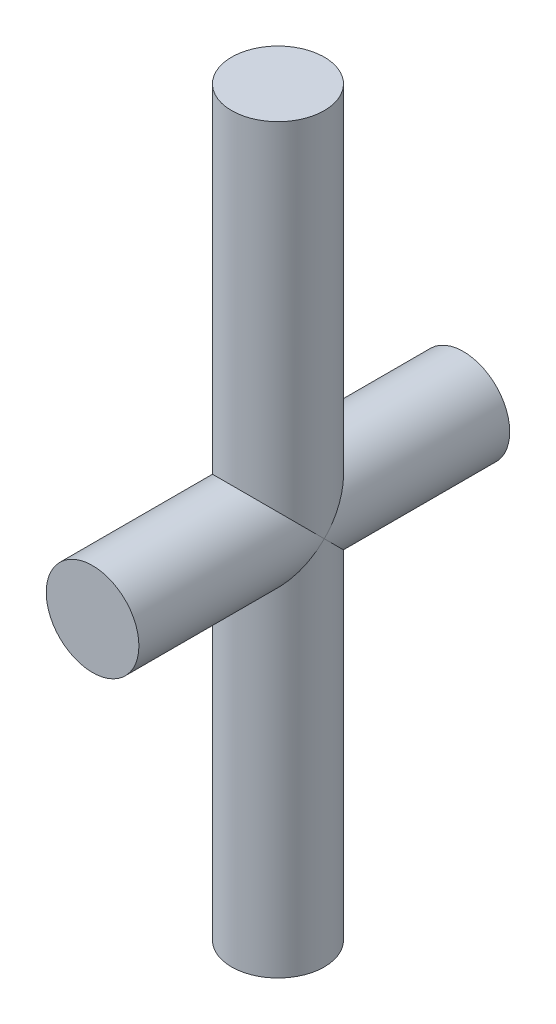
from build123d import *

# Parameters (mm, degrees)
SKETCH1_R           = 12.5
BOSS_EXTRUDE1_DEPTH = 50
SKETCH2_R           = 12.5
BOSS_EXTRUDE2_DEPTH = 100


with BuildPart() as part:
    # Sketch1 → Boss-Extrude1 (new, symmetric)
    with BuildSketch(Plane.XY):
        with Locations(Location((0, 0, 0), (0, 0, 180))):
            Circle(SKETCH1_R)
    extrude(amount=BOSS_EXTRUDE1_DEPTH, both=True)

    # Sketch2 → Boss-Extrude2 (add, symmetric)
    with BuildSketch(Plane(origin=(0, 0, 0), x_dir=(1, 0, 0), z_dir=(0, 1, 0))):
        Circle(SKETCH2_R)
    extrude(amount=BOSS_EXTRUDE2_DEPTH, both=True)


solid = part.part
